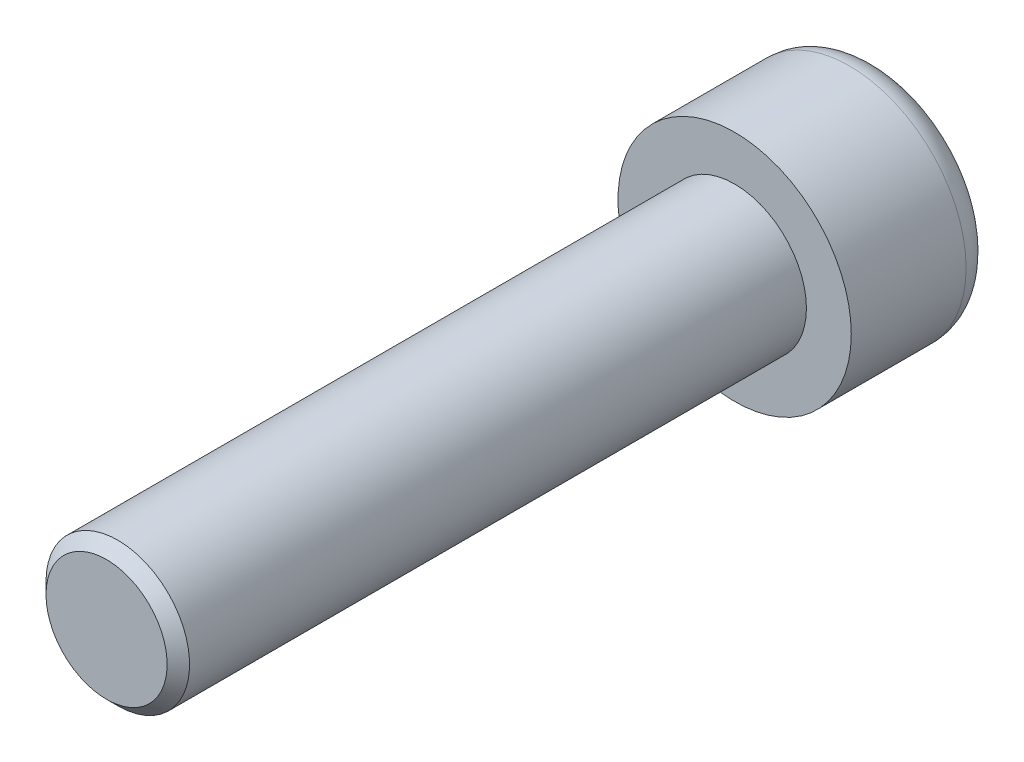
from build123d import *

# Parameters (mm, degrees)
PROFIL_T_TE_R         = 6.5
TETE_DEPTH            = 8
SIX_PANS_DEPTH        = 5
CONGE_R               = 1.6
PROFIL_CYLINDRE_R     = 4
CYLINDRE_FILETE_DEPTH = 35


with BuildPart() as part:
    # profil t_te → TETE (new body)
    with BuildSketch(Plane.XY):
        Circle(PROFIL_T_TE_R)
    extrude(amount=TETE_DEPTH)

    # profil six pans → SIX PANS (cut)
    with BuildSketch(Plane(origin=(0, 0, 0), x_dir=(-1, 0, 0), z_dir=(0, 0, -1))):
        Polygon((0, 3.464101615), (-3, 1.732050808), (-3, -1.732050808), (0, -3.464101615), (3, -1.732050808), (3, 1.732050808), align=None)
    extrude(amount=-SIX_PANS_DEPTH, mode=Mode.SUBTRACT)

    # CONGE
    conge_edges = [part.edges().sort_by_distance(p)[0] for p in [
        (-6.5, 0, 0),
    ]]
    fillet(conge_edges, radius=CONGE_R)

    # profil cylindre → CYLINDRE FILETE (add)
    with BuildSketch(Plane.XY.offset(8)):
        Circle(PROFIL_CYLINDRE_R)
    extrude(amount=CYLINDRE_FILETE_DEPTH)

    # profil chanfrein → CHANFREIN FILET (revolve, cut)
    with BuildSketch(Plane(origin=(0, 0, 0), x_dir=(0, 0, -1), z_dir=(1, 0, 0)), mode=Mode.PRIVATE) as chanfrein_filet_sk:
        Polygon((-43, 3.375), (-42.375, 4), (-43, 4), align=None)
    revolve(chanfrein_filet_sk.sketch.rotate(Axis((0, 0, 12.087417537), (0, 0, 1)), 90), axis=Axis((0, 0, 12.087417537), (0, 0, 1)), mode=Mode.SUBTRACT)


solid = part.part
